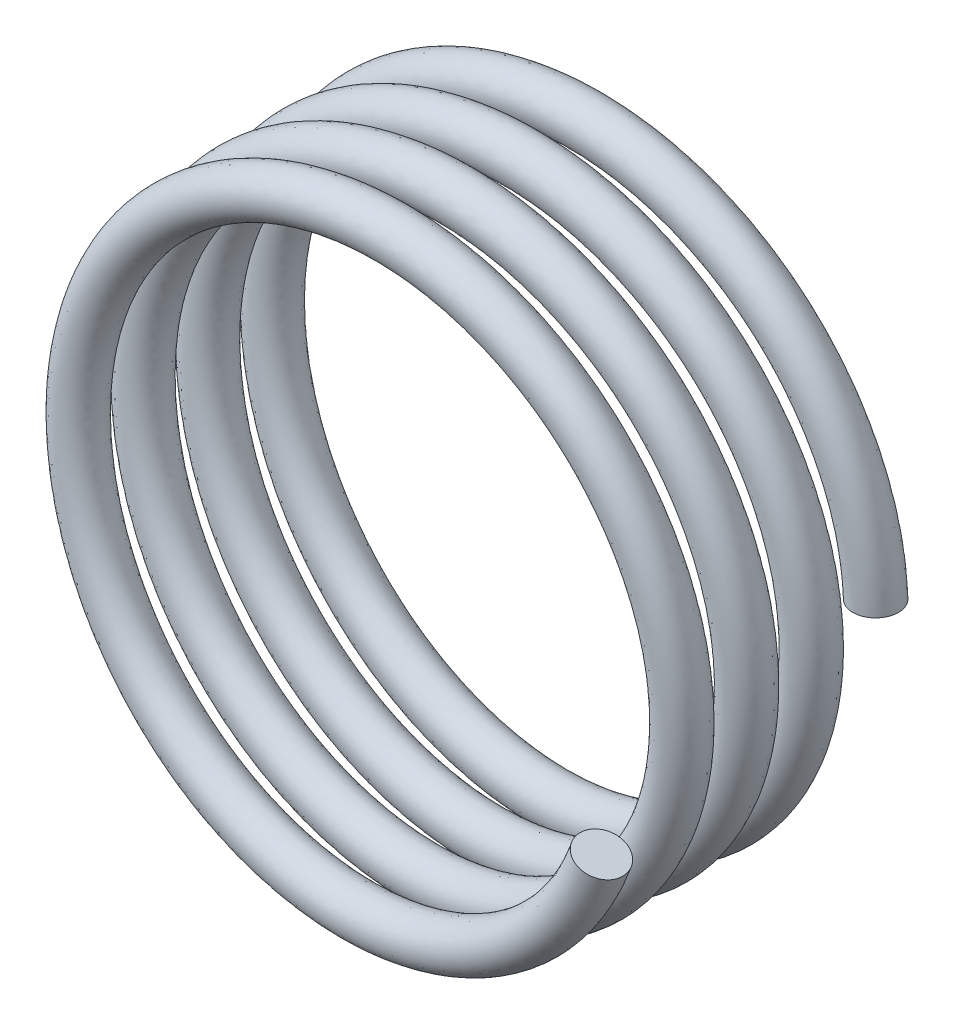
from build123d import *

# Parameters (mm, degrees)
MUELLE_B_PITCH  = 1.7
MUELLE_B_HEIGHT = 6.7
MUELLE_B_RADIUS = 7.5
SK_ALAMBRE_R    = 0.6


with BuildPart() as part:
    # Muelle_B: sweep along a helix
    with BuildLine() as muelle_b_path:
        Helix(MUELLE_B_PITCH, MUELLE_B_HEIGHT, MUELLE_B_RADIUS, center=(-6, -26, 115.103887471), direction=(0, 0, 1))
    # Sk_alambre → Muelle_B (sweep)
    with BuildSketch(Plane(origin=(0, -26, 0), x_dir=(1, 0, 0), z_dir=(0, 1, 0))):
        with Locations((1.5, -55)):
            Circle(SK_ALAMBRE_R)
    sweep(path=muelle_b_path.line, is_frenet=True)


solid = part.part
